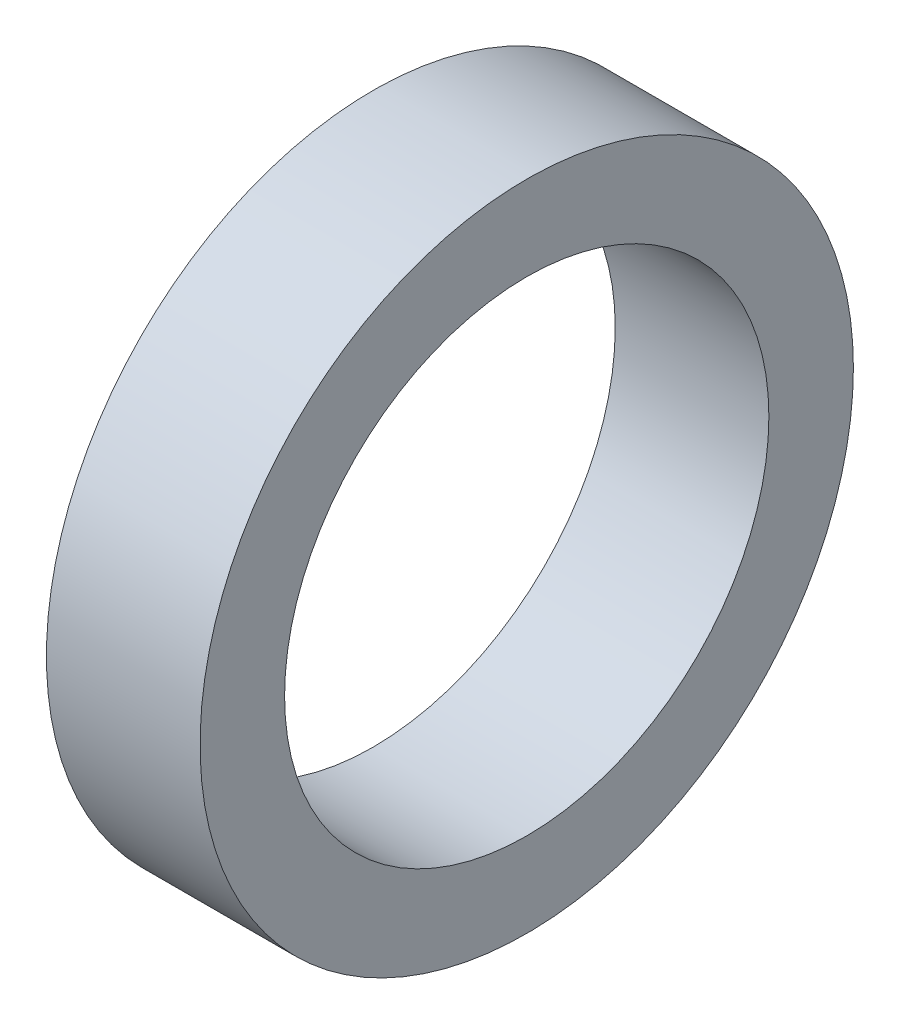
from build123d import *

# Parameters (mm, degrees)
SKETCH1_R      = 13.5001
SKETCH1_R_2    = 10.0076
EXTRUDE1_DEPTH = 6.35


with BuildPart() as part:
    # Sketch1 → Extrude1 (new body)
    with BuildSketch(Plane(origin=(0, 0, 0), x_dir=(0, 0, -1), z_dir=(1, 0, 0))):
        Circle(SKETCH1_R)
        Circle(SKETCH1_R_2, mode=Mode.SUBTRACT)
    extrude(amount=EXTRUDE1_DEPTH)


solid = part.part
